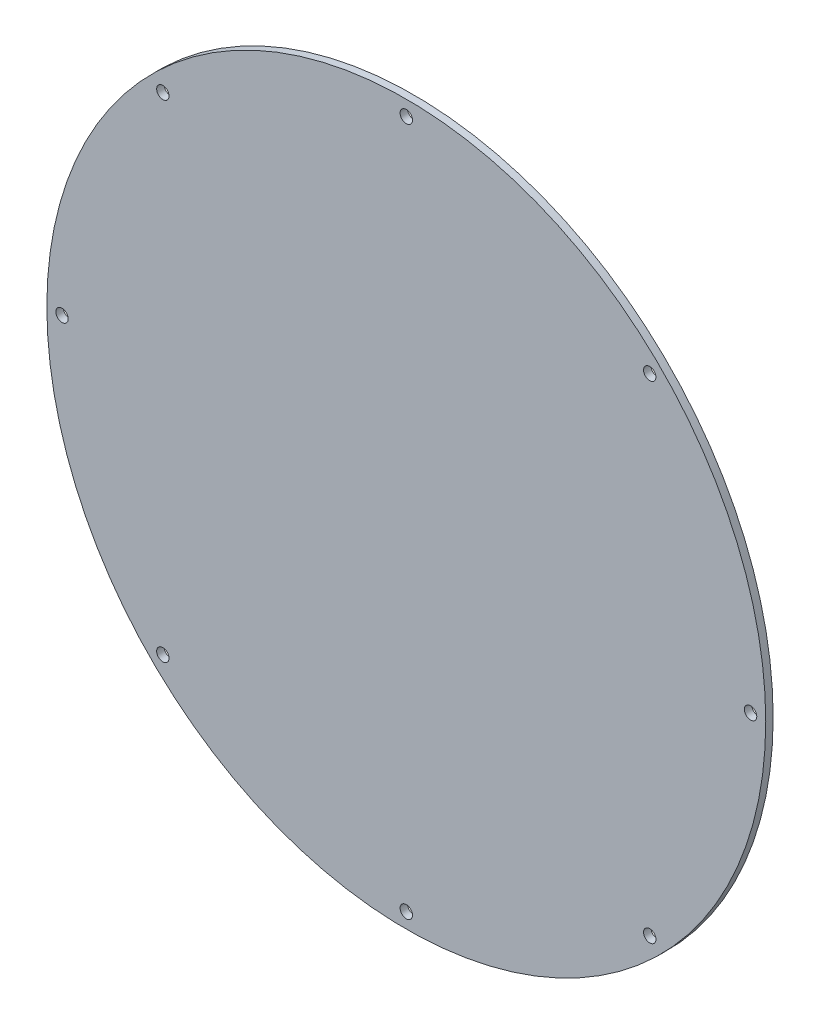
ISO-10303-21;
HEADER;
FILE_DESCRIPTION(('STEP AP214'),'2;1');
FILE_NAME('part.step','',(''),(''),'','','');
FILE_SCHEMA(('AUTOMOTIVE_DESIGN { 1 0 10303 214 1 1 1 1 }'));
ENDSEC;
DATA;
#1=APPLICATION_CONTEXT('core data for automotive mechanical design processes');
#2=APPLICATION_PROTOCOL_DEFINITION('international standard','automotive_design',2000,#1);
#3=PRODUCT_CONTEXT('',#1,'mechanical');
#4=PRODUCT('Part','Part','',(#3));
#5=PRODUCT_RELATED_PRODUCT_CATEGORY('part','',(#4));
#6=PRODUCT_DEFINITION_FORMATION('','',#4);
#7=PRODUCT_DEFINITION_CONTEXT('part definition',#1,'design');
#8=PRODUCT_DEFINITION('design','',#6,#7);
#9=PRODUCT_DEFINITION_SHAPE('','',#8);
#10=(LENGTH_UNIT() NAMED_UNIT(*) SI_UNIT(.MILLI.,.METRE.));
#11=(NAMED_UNIT(*) PLANE_ANGLE_UNIT() SI_UNIT($,.RADIAN.));
#12=(NAMED_UNIT(*) SI_UNIT($,.STERADIAN.) SOLID_ANGLE_UNIT());
#13=UNCERTAINTY_MEASURE_WITH_UNIT(LENGTH_MEASURE(1.E-05),#10,'distance_accuracy_value','');
#14=(GEOMETRIC_REPRESENTATION_CONTEXT(3) GLOBAL_UNCERTAINTY_ASSIGNED_CONTEXT((#13)) GLOBAL_UNIT_ASSIGNED_CONTEXT((#10,
#11,#12)) REPRESENTATION_CONTEXT('',''));
#15=CARTESIAN_POINT('',(0.,0.,0.));
#16=DIRECTION('',(0.,0.,1.));
#17=DIRECTION('',(1.,0.,0.));
#18=AXIS2_PLACEMENT_3D('',#15,#16,#17);
#19=CARTESIAN_POINT('',(0.,0.,3.17500000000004));
#20=DIRECTION('',(0.,0.,-1.));
#21=DIRECTION('',(-1.,0.,0.));
#22=AXIS2_PLACEMENT_3D('',#19,#20,#21);
#23=CYLINDRICAL_SURFACE('',#22,154.);
#24=CARTESIAN_POINT('',(0.,0.,3.17500000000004));
#25=DIRECTION('',(0.,0.,1.));
#26=DIRECTION('',(1.,0.,0.));
#27=AXIS2_PLACEMENT_3D('',#24,#25,#26);
#28=CIRCLE('',#27,154.);
#29=CARTESIAN_POINT('',(-154.,0.,3.17500000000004));
#30=VERTEX_POINT('',#29);
#31=EDGE_CURVE('E10',#30,#30,#28,.T.);
#32=CARTESIAN_POINT('',(0.,0.,0.));
#33=DIRECTION('',(0.,0.,1.));
#34=DIRECTION('',(1.,0.,0.));
#35=AXIS2_PLACEMENT_3D('',#32,#33,#34);
#36=CIRCLE('',#35,154.);
#37=CARTESIAN_POINT('',(-154.,0.,0.));
#38=VERTEX_POINT('',#37);
#39=EDGE_CURVE('E37',#38,#38,#36,.T.);
#40=CARTESIAN_POINT('',(-154.,0.,3.17500000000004));
#41=CARTESIAN_POINT('',(-154.,0.,3.14192708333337));
#42=CARTESIAN_POINT('',(-154.,0.,3.1088541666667));
#43=CARTESIAN_POINT('',(-154.,0.,3.04270833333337));
#44=CARTESIAN_POINT('',(-154.,0.,3.0096354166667));
#45=CARTESIAN_POINT('',(-154.,0.,2.94348958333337));
#46=CARTESIAN_POINT('',(-154.,0.,2.9104166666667));
#47=CARTESIAN_POINT('',(-154.,0.,2.84427083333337));
#48=CARTESIAN_POINT('',(-154.,0.,2.8111979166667));
#49=CARTESIAN_POINT('',(-154.,0.,2.74505208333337));
#50=CARTESIAN_POINT('',(-154.,0.,2.7119791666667));
#51=CARTESIAN_POINT('',(-154.,0.,2.64583333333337));
#52=CARTESIAN_POINT('',(-154.,0.,2.6127604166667));
#53=CARTESIAN_POINT('',(-154.,0.,2.54661458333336));
#54=CARTESIAN_POINT('',(-154.,0.,2.5135416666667));
#55=CARTESIAN_POINT('',(-154.,0.,2.44739583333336));
#56=CARTESIAN_POINT('',(-154.,0.,2.4143229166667));
#57=CARTESIAN_POINT('',(-154.,0.,2.34817708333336));
#58=CARTESIAN_POINT('',(-154.,0.,2.31510416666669));
#59=CARTESIAN_POINT('',(-154.,0.,2.24895833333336));
#60=CARTESIAN_POINT('',(-154.,0.,2.21588541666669));
#61=CARTESIAN_POINT('',(-154.,0.,2.14973958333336));
#62=CARTESIAN_POINT('',(-154.,0.,2.11666666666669));
#63=CARTESIAN_POINT('',(-154.,0.,2.05052083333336));
#64=CARTESIAN_POINT('',(-154.,0.,2.01744791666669));
#65=CARTESIAN_POINT('',(-154.,0.,1.95130208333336));
#66=CARTESIAN_POINT('',(-154.,0.,1.91822916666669));
#67=CARTESIAN_POINT('',(-154.,0.,1.85208333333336));
#68=CARTESIAN_POINT('',(-154.,0.,1.81901041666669));
#69=CARTESIAN_POINT('',(-154.,0.,1.75286458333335));
#70=CARTESIAN_POINT('',(-154.,0.,1.71979166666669));
#71=CARTESIAN_POINT('',(-154.,0.,1.65364583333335));
#72=CARTESIAN_POINT('',(-154.,0.,1.62057291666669));
#73=CARTESIAN_POINT('',(-154.,0.,1.55442708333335));
#74=CARTESIAN_POINT('',(-154.,0.,1.52135416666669));
#75=CARTESIAN_POINT('',(-154.,0.,1.45520833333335));
#76=CARTESIAN_POINT('',(-154.,0.,1.42213541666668));
#77=CARTESIAN_POINT('',(-154.,0.,1.35598958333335));
#78=CARTESIAN_POINT('',(-154.,0.,1.32291666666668));
#79=CARTESIAN_POINT('',(-154.,0.,1.25677083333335));
#80=CARTESIAN_POINT('',(-154.,0.,1.22369791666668));
#81=CARTESIAN_POINT('',(-154.,0.,1.15755208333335));
#82=CARTESIAN_POINT('',(-154.,0.,1.12447916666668));
#83=CARTESIAN_POINT('',(-154.,0.,1.05833333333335));
#84=CARTESIAN_POINT('',(-154.,0.,1.02526041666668));
#85=CARTESIAN_POINT('',(-154.,0.,0.959114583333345));
#86=CARTESIAN_POINT('',(-154.,0.,0.926041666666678));
#87=CARTESIAN_POINT('',(-154.,0.,0.859895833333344));
#88=CARTESIAN_POINT('',(-154.,0.,0.826822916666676));
#89=CARTESIAN_POINT('',(-154.,0.,0.760677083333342));
#90=CARTESIAN_POINT('',(-154.,0.,0.727604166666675));
#91=CARTESIAN_POINT('',(-154.,0.,0.661458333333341));
#92=CARTESIAN_POINT('',(-154.,0.,0.628385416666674));
#93=CARTESIAN_POINT('',(-154.,0.,0.56223958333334));
#94=CARTESIAN_POINT('',(-154.,0.,0.529166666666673));
#95=CARTESIAN_POINT('',(-154.,0.,0.463020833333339));
#96=CARTESIAN_POINT('',(-154.,0.,0.429947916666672));
#97=CARTESIAN_POINT('',(-154.,0.,0.363802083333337));
#98=CARTESIAN_POINT('',(-154.,0.,0.33072916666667));
#99=CARTESIAN_POINT('',(-154.,0.,0.264583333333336));
#100=CARTESIAN_POINT('',(-154.,0.,0.231510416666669));
#101=CARTESIAN_POINT('',(-154.,0.,0.165364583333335));
#102=CARTESIAN_POINT('',(-154.,0.,0.132291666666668));
#103=CARTESIAN_POINT('',(-154.,0.,0.0661458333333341));
#104=CARTESIAN_POINT('',(-154.,0.,0.0330729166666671));
#105=CARTESIAN_POINT('',(-154.,0.,0.));
#106=B_SPLINE_CURVE_WITH_KNOTS('',3,(#40,#41,#42,#43,#44,#45,#46,#47,#48,#49,#50,#51,#52,#53,
#54,#55,#56,#57,#58,#59,#60,#61,#62,#63,#64,#65,#66,#67,#68,#69,#70,#71,#72,#73,#74,#75,#76,#77,
#78,#79,#80,#81,#82,#83,#84,#85,#86,#87,#88,#89,#90,#91,#92,#93,#94,#95,#96,#97,#98,#99,#100,
#101,#102,#103,#104,#105),.UNSPECIFIED.,.F.,.F.,(4,2,2,2,2,2,2,2,2,2,2,2,2,2,2,2,2,2,2,2,2,2,2,
2,2,2,2,2,2,2,2,2,4),(0.,0.0992187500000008,0.198437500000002,0.297656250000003,
0.396875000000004,0.496093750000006,0.595312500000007,0.694531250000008,0.793750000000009,
0.892968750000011,0.992187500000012,1.09140625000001,1.19062500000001,1.28984375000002,
1.38906250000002,1.48828125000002,1.58750000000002,1.68671875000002,1.78593750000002,
1.88515625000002,1.98437500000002,2.08359375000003,2.18281250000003,2.28203125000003,
2.38125000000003,2.48046875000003,2.57968750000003,2.67890625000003,2.77812500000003,
2.87734375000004,2.97656250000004,3.07578125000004,3.17500000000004),.UNSPECIFIED.);
#107=EDGE_CURVE('BSEAM34',#30,#38,#106,.T.);
#108=ORIENTED_EDGE('',*,*,#31,.F.);
#109=ORIENTED_EDGE('',*,*,#39,.T.);
#110=ORIENTED_EDGE('',*,*,#107,.T.);
#111=ORIENTED_EDGE('',*,*,#107,.F.);
#112=EDGE_LOOP('',(#108,#110,#109,#111));
#113=FACE_BOUND('',#112,.T.);
#114=ADVANCED_FACE('F34',(#113),#23,.T.);
#115=CARTESIAN_POINT('',(0.,0.,3.17500000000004));
#116=DIRECTION('',(0.,0.,1.));
#117=DIRECTION('',(1.,0.,0.));
#118=AXIS2_PLACEMENT_3D('',#115,#116,#117);
#119=PLANE('',#118);
#120=CARTESIAN_POINT('',(104.298250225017,-104.298250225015,3.17500000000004));
#121=DIRECTION('',(0.,0.,1.));
#122=DIRECTION('',(0.707106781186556,-0.707106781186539,0.));
#123=AXIS2_PLACEMENT_3D('',#120,#121,#122);
#124=CIRCLE('',#123,2.64999999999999);
#125=CARTESIAN_POINT('',(106.172083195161,-106.172083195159,3.17500000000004));
#126=VERTEX_POINT('',#125);
#127=EDGE_CURVE('E90',#126,#126,#124,.T.);
#128=ORIENTED_EDGE('',*,*,#127,.F.);
#129=EDGE_LOOP('',(#128));
#130=FACE_BOUND('',#129,.T.);
#131=CARTESIAN_POINT('',(9.99200722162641E-13,-147.5,3.17500000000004));
#132=DIRECTION('',(0.,0.,1.));
#133=DIRECTION('',(0.,-1.,0.));
#134=AXIS2_PLACEMENT_3D('',#131,#132,#133);
#135=CIRCLE('',#134,2.64999999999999);
#136=CARTESIAN_POINT('',(1.02709312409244E-12,-150.15,3.17500000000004));
#137=VERTEX_POINT('',#136);
#138=EDGE_CURVE('E84',#137,#137,#135,.T.);
#139=ORIENTED_EDGE('',*,*,#138,.F.);
#140=EDGE_LOOP('',(#139));
#141=FACE_BOUND('',#140,.T.);
#142=CARTESIAN_POINT('',(-104.298250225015,-104.298250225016,3.17500000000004));
#143=DIRECTION('',(0.,0.,1.));
#144=DIRECTION('',(-0.707106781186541,-0.707106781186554,0.));
#145=AXIS2_PLACEMENT_3D('',#142,#143,#144);
#146=CIRCLE('',#145,2.64999999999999);
#147=CARTESIAN_POINT('',(-106.17208319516,-106.172083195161,3.17500000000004));
#148=VERTEX_POINT('',#147);
#149=EDGE_CURVE('E78',#148,#148,#146,.T.);
#150=ORIENTED_EDGE('',*,*,#149,.F.);
#151=EDGE_LOOP('',(#150));
#152=FACE_BOUND('',#151,.T.);
#153=CARTESIAN_POINT('',(-147.5,5.55111512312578E-13,3.17500000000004));
#154=DIRECTION('',(0.,0.,1.));
#155=DIRECTION('',(-1.,0.,0.));
#156=AXIS2_PLACEMENT_3D('',#153,#154,#155);
#157=CIRCLE('',#156,2.64999999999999);
#158=CARTESIAN_POINT('',(-150.15,5.55247124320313E-13,3.17500000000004));
#159=VERTEX_POINT('',#158);
#160=EDGE_CURVE('E72',#159,#159,#157,.T.);
#161=ORIENTED_EDGE('',*,*,#160,.F.);
#162=EDGE_LOOP('',(#161));
#163=FACE_BOUND('',#162,.T.);
#164=CARTESIAN_POINT('',(-104.298250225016,104.298250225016,3.17500000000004));
#165=DIRECTION('',(0.,0.,1.));
#166=DIRECTION('',(-0.707106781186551,0.707106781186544,0.));
#167=AXIS2_PLACEMENT_3D('',#164,#165,#166);
#168=CIRCLE('',#167,2.64999999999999);
#169=CARTESIAN_POINT('',(-106.17208319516,106.17208319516,3.17500000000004));
#170=VERTEX_POINT('',#169);
#171=EDGE_CURVE('E66',#170,#170,#168,.T.);
#172=ORIENTED_EDGE('',*,*,#171,.F.);
#173=EDGE_LOOP('',(#172));
#174=FACE_BOUND('',#173,.T.);
#175=CARTESIAN_POINT('',(0.,147.5,3.17500000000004));
#176=DIRECTION('',(0.,0.,1.));
#177=DIRECTION('',(0.,1.,0.));
#178=AXIS2_PLACEMENT_3D('',#175,#176,#177);
#179=CIRCLE('',#178,2.64999999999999);
#180=CARTESIAN_POINT('',(0.,150.15,3.17500000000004));
#181=VERTEX_POINT('',#180);
#182=EDGE_CURVE('E60',#181,#181,#179,.T.);
#183=ORIENTED_EDGE('',*,*,#182,.F.);
#184=EDGE_LOOP('',(#183));
#185=FACE_BOUND('',#184,.T.);
#186=CARTESIAN_POINT('',(104.298250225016,104.298250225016,3.17500000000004));
#187=DIRECTION('',(0.,0.,1.));
#188=DIRECTION('',(0.707106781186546,0.707106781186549,0.));
#189=AXIS2_PLACEMENT_3D('',#186,#187,#188);
#190=CIRCLE('',#189,2.64999999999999);
#191=CARTESIAN_POINT('',(106.17208319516,106.17208319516,3.17500000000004));
#192=VERTEX_POINT('',#191);
#193=EDGE_CURVE('E54',#192,#192,#190,.T.);
#194=ORIENTED_EDGE('',*,*,#193,.F.);
#195=EDGE_LOOP('',(#194));
#196=FACE_BOUND('',#195,.T.);
#197=CARTESIAN_POINT('',(147.5,-4.9960036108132E-13,3.17500000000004));
#198=DIRECTION('',(0.,0.,1.));
#199=DIRECTION('',(1.,0.,0.));
#200=AXIS2_PLACEMENT_3D('',#197,#198,#199);
#201=CIRCLE('',#200,2.64999999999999);
#202=CARTESIAN_POINT('',(150.15,-4.99735973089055E-13,3.17500000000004));
#203=VERTEX_POINT('',#202);
#204=EDGE_CURVE('E48',#203,#203,#201,.T.);
#205=ORIENTED_EDGE('',*,*,#204,.F.);
#206=EDGE_LOOP('',(#205));
#207=FACE_BOUND('',#206,.T.);
#208=ORIENTED_EDGE('',*,*,#31,.T.);
#209=EDGE_LOOP('',(#208));
#210=FACE_BOUND('',#209,.T.);
#211=ADVANCED_FACE('F97',(#130,#141,#152,#163,#174,#185,#196,#207,#210),#119,.T.);
#212=CARTESIAN_POINT('',(0.,0.,0.));
#213=DIRECTION('',(0.,0.,1.));
#214=DIRECTION('',(1.,0.,0.));
#215=AXIS2_PLACEMENT_3D('',#212,#213,#214);
#216=PLANE('',#215);
#217=CARTESIAN_POINT('',(104.298250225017,-104.298250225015,0.));
#218=DIRECTION('',(0.,0.,1.));
#219=DIRECTION('',(0.707106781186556,-0.707106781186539,0.));
#220=AXIS2_PLACEMENT_3D('',#217,#218,#219);
#221=CIRCLE('',#220,2.64999999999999);
#222=CARTESIAN_POINT('',(106.172083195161,-106.172083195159,0.));
#223=VERTEX_POINT('',#222);
#224=EDGE_CURVE('E87',#223,#223,#221,.T.);
#225=ORIENTED_EDGE('',*,*,#224,.T.);
#226=EDGE_LOOP('',(#225));
#227=FACE_BOUND('',#226,.T.);
#228=CARTESIAN_POINT('',(1.11022302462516E-12,-147.5,0.));
#229=DIRECTION('',(0.,0.,1.));
#230=DIRECTION('',(0.,-1.,0.));
#231=AXIS2_PLACEMENT_3D('',#228,#229,#230);
#232=CIRCLE('',#231,2.64999999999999);
#233=CARTESIAN_POINT('',(1.02709312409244E-12,-150.15,0.));
#234=VERTEX_POINT('',#233);
#235=EDGE_CURVE('E81',#234,#234,#232,.T.);
#236=ORIENTED_EDGE('',*,*,#235,.T.);
#237=EDGE_LOOP('',(#236));
#238=FACE_BOUND('',#237,.T.);
#239=CARTESIAN_POINT('',(-104.298250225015,-104.298250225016,0.));
#240=DIRECTION('',(0.,0.,1.));
#241=DIRECTION('',(-0.707106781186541,-0.707106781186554,0.));
#242=AXIS2_PLACEMENT_3D('',#239,#240,#241);
#243=CIRCLE('',#242,2.64999999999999);
#244=CARTESIAN_POINT('',(-106.17208319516,-106.172083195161,0.));
#245=VERTEX_POINT('',#244);
#246=EDGE_CURVE('E75',#245,#245,#243,.T.);
#247=ORIENTED_EDGE('',*,*,#246,.T.);
#248=EDGE_LOOP('',(#247));
#249=FACE_BOUND('',#248,.T.);
#250=CARTESIAN_POINT('',(-147.5,4.9960036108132E-13,0.));
#251=DIRECTION('',(0.,0.,1.));
#252=DIRECTION('',(-1.,0.,0.));
#253=AXIS2_PLACEMENT_3D('',#250,#251,#252);
#254=CIRCLE('',#253,2.64999999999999);
#255=CARTESIAN_POINT('',(-150.15,5.55225093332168E-13,0.));
#256=VERTEX_POINT('',#255);
#257=EDGE_CURVE('E69',#256,#256,#254,.T.);
#258=ORIENTED_EDGE('',*,*,#257,.T.);
#259=EDGE_LOOP('',(#258));
#260=FACE_BOUND('',#259,.T.);
#261=CARTESIAN_POINT('',(-104.298250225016,104.298250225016,0.));
#262=DIRECTION('',(0.,0.,1.));
#263=DIRECTION('',(-0.707106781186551,0.707106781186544,0.));
#264=AXIS2_PLACEMENT_3D('',#261,#262,#263);
#265=CIRCLE('',#264,2.64999999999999);
#266=CARTESIAN_POINT('',(-106.17208319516,106.17208319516,0.));
#267=VERTEX_POINT('',#266);
#268=EDGE_CURVE('E63',#267,#267,#265,.T.);
#269=ORIENTED_EDGE('',*,*,#268,.T.);
#270=EDGE_LOOP('',(#269));
#271=FACE_BOUND('',#270,.T.);
#272=CARTESIAN_POINT('',(-1.11022302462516E-13,147.5,0.));
#273=DIRECTION('',(0.,0.,1.));
#274=DIRECTION('',(0.,1.,0.));
#275=AXIS2_PLACEMENT_3D('',#272,#273,#274);
#276=CIRCLE('',#275,2.64999999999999);
#277=CARTESIAN_POINT('',(0.,150.15,0.));
#278=VERTEX_POINT('',#277);
#279=EDGE_CURVE('E57',#278,#278,#276,.T.);
#280=ORIENTED_EDGE('',*,*,#279,.T.);
#281=EDGE_LOOP('',(#280));
#282=FACE_BOUND('',#281,.T.);
#283=CARTESIAN_POINT('',(104.298250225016,104.298250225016,0.));
#284=DIRECTION('',(0.,0.,1.));
#285=DIRECTION('',(0.707106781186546,0.707106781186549,0.));
#286=AXIS2_PLACEMENT_3D('',#283,#284,#285);
#287=CIRCLE('',#286,2.64999999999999);
#288=CARTESIAN_POINT('',(106.17208319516,106.17208319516,0.));
#289=VERTEX_POINT('',#288);
#290=EDGE_CURVE('E51',#289,#289,#287,.T.);
#291=ORIENTED_EDGE('',*,*,#290,.T.);
#292=EDGE_LOOP('',(#291));
#293=FACE_BOUND('',#292,.T.);
#294=CARTESIAN_POINT('',(147.5,-4.44089209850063E-13,0.));
#295=DIRECTION('',(0.,0.,1.));
#296=DIRECTION('',(1.,0.,0.));
#297=AXIS2_PLACEMENT_3D('',#294,#295,#296);
#298=CIRCLE('',#297,2.64999999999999);
#299=CARTESIAN_POINT('',(150.15,-4.997580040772E-13,0.));
#300=VERTEX_POINT('',#299);
#301=EDGE_CURVE('E44',#300,#300,#298,.T.);
#302=ORIENTED_EDGE('',*,*,#301,.T.);
#303=EDGE_LOOP('',(#302));
#304=FACE_BOUND('',#303,.T.);
#305=ORIENTED_EDGE('',*,*,#39,.F.);
#306=EDGE_LOOP('',(#305));
#307=FACE_BOUND('',#306,.T.);
#308=ADVANCED_FACE('F100',(#227,#238,#249,#260,#271,#282,#293,#304,#307),#216,.F.);
#309=CARTESIAN_POINT('',(147.5,-4.9960036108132E-13,3.17500000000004));
#310=DIRECTION('',(0.,0.,1.));
#311=DIRECTION('',(1.,0.,0.));
#312=AXIS2_PLACEMENT_3D('',#309,#310,#311);
#313=CYLINDRICAL_SURFACE('',#312,2.64999999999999);
#314=CARTESIAN_POINT('',(150.15,-4.99735973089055E-13,3.17500000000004));
#315=CARTESIAN_POINT('',(150.15,-4.99736202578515E-13,3.14192708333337));
#316=CARTESIAN_POINT('',(150.15,-4.99736432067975E-13,3.1088541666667));
#317=CARTESIAN_POINT('',(150.15,-4.99736891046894E-13,3.04270833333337));
#318=CARTESIAN_POINT('',(150.15,-4.99737120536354E-13,3.0096354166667));
#319=CARTESIAN_POINT('',(150.15,-4.99737579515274E-13,2.94348958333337));
#320=CARTESIAN_POINT('',(150.15,-4.99737809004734E-13,2.9104166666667));
#321=CARTESIAN_POINT('',(150.15,-4.99738267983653E-13,2.84427083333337));
#322=CARTESIAN_POINT('',(150.15,-4.99738497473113E-13,2.8111979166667));
#323=CARTESIAN_POINT('',(150.15,-4.99738956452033E-13,2.74505208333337));
#324=CARTESIAN_POINT('',(150.15,-4.99739185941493E-13,2.7119791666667));
#325=CARTESIAN_POINT('',(150.15,-4.99739644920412E-13,2.64583333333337));
#326=CARTESIAN_POINT('',(150.15,-4.99739874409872E-13,2.6127604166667));
#327=CARTESIAN_POINT('',(150.15,-4.99740333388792E-13,2.54661458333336));
#328=CARTESIAN_POINT('',(150.15,-4.99740562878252E-13,2.5135416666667));
#329=CARTESIAN_POINT('',(150.15,-4.99741021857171E-13,2.44739583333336));
#330=CARTESIAN_POINT('',(150.15,-4.99741251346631E-13,2.4143229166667));
#331=CARTESIAN_POINT('',(150.15,-4.99741710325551E-13,2.34817708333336));
#332=CARTESIAN_POINT('',(150.15,-4.99741939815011E-13,2.31510416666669));
#333=CARTESIAN_POINT('',(150.15,-4.99742398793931E-13,2.24895833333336));
#334=CARTESIAN_POINT('',(150.15,-4.9974262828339E-13,2.21588541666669));
#335=CARTESIAN_POINT('',(150.15,-4.9974308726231E-13,2.14973958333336));
#336=CARTESIAN_POINT('',(150.15,-4.9974331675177E-13,2.11666666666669));
#337=CARTESIAN_POINT('',(150.15,-4.9974377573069E-13,2.05052083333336));
#338=CARTESIAN_POINT('',(150.15,-4.99744005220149E-13,2.01744791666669));
#339=CARTESIAN_POINT('',(150.15,-4.99744464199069E-13,1.95130208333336));
#340=CARTESIAN_POINT('',(150.15,-4.99744693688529E-13,1.91822916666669));
#341=CARTESIAN_POINT('',(150.15,-4.99745152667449E-13,1.85208333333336));
#342=CARTESIAN_POINT('',(150.15,-4.99745382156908E-13,1.81901041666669));
#343=CARTESIAN_POINT('',(150.15,-4.99745841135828E-13,1.75286458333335));
#344=CARTESIAN_POINT('',(150.15,-4.99746070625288E-13,1.71979166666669));
#345=CARTESIAN_POINT('',(150.15,-4.99746529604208E-13,1.65364583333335));
#346=CARTESIAN_POINT('',(150.15,-4.99746759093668E-13,1.62057291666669));
#347=CARTESIAN_POINT('',(150.15,-4.99747218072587E-13,1.55442708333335));
#348=CARTESIAN_POINT('',(150.15,-4.99747447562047E-13,1.52135416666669));
#349=CARTESIAN_POINT('',(150.15,-4.99747906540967E-13,1.45520833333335));
#350=CARTESIAN_POINT('',(150.15,-4.99748136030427E-13,1.42213541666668));
#351=CARTESIAN_POINT('',(150.15,-4.99748595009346E-13,1.35598958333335));
#352=CARTESIAN_POINT('',(150.15,-4.99748824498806E-13,1.32291666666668));
#353=CARTESIAN_POINT('',(150.15,-4.99749283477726E-13,1.25677083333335));
#354=CARTESIAN_POINT('',(150.15,-4.99749512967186E-13,1.22369791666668));
#355=CARTESIAN_POINT('',(150.15,-4.99749971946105E-13,1.15755208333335));
#356=CARTESIAN_POINT('',(150.15,-4.99750201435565E-13,1.12447916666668));
#357=CARTESIAN_POINT('',(150.15,-4.99750660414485E-13,1.05833333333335));
#358=CARTESIAN_POINT('',(150.15,-4.99750889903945E-13,1.02526041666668));
#359=CARTESIAN_POINT('',(150.15,-4.99751348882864E-13,0.959114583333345));
#360=CARTESIAN_POINT('',(150.15,-4.99751578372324E-13,0.926041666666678));
#361=CARTESIAN_POINT('',(150.15,-4.99752037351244E-13,0.859895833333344));
#362=CARTESIAN_POINT('',(150.15,-4.99752266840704E-13,0.826822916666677));
#363=CARTESIAN_POINT('',(150.15,-4.99752725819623E-13,0.760677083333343));
#364=CARTESIAN_POINT('',(150.15,-4.99752955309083E-13,0.727604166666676));
#365=CARTESIAN_POINT('',(150.15,-4.99753414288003E-13,0.661458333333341));
#366=CARTESIAN_POINT('',(150.15,-4.99753643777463E-13,0.628385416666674));
#367=CARTESIAN_POINT('',(150.15,-4.99754102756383E-13,0.56223958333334));
#368=CARTESIAN_POINT('',(150.15,-4.99754332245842E-13,0.529166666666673));
#369=CARTESIAN_POINT('',(150.15,-4.99754791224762E-13,0.463020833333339));
#370=CARTESIAN_POINT('',(150.15,-4.99755020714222E-13,0.429947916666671));
#371=CARTESIAN_POINT('',(150.15,-4.99755479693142E-13,0.363802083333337));
#372=CARTESIAN_POINT('',(150.15,-4.99755709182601E-13,0.33072916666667));
#373=CARTESIAN_POINT('',(150.15,-4.99756168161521E-13,0.264583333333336));
#374=CARTESIAN_POINT('',(150.15,-4.99756397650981E-13,0.231510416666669));
#375=CARTESIAN_POINT('',(150.15,-4.99756856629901E-13,0.165364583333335));
#376=CARTESIAN_POINT('',(150.15,-4.9975708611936E-13,0.132291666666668));
#377=CARTESIAN_POINT('',(150.15,-4.9975754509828E-13,0.0661458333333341));
#378=CARTESIAN_POINT('',(150.15,-4.9975777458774E-13,0.0330729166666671));
#379=CARTESIAN_POINT('',(150.15,-4.997580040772E-13,0.));
#380=B_SPLINE_CURVE_WITH_KNOTS('',3,(#314,#315,#316,#317,#318,#319,#320,#321,#322,#323,#324,
#325,#326,#327,#328,#329,#330,#331,#332,#333,#334,#335,#336,#337,#338,#339,#340,#341,#342,#343,
#344,#345,#346,#347,#348,#349,#350,#351,#352,#353,#354,#355,#356,#357,#358,#359,#360,#361,#362,
#363,#364,#365,#366,#367,#368,#369,#370,#371,#372,#373,#374,#375,#376,#377,#378,#379),
.UNSPECIFIED.,.F.,.F.,(4,2,2,2,2,2,2,2,2,2,2,2,2,2,2,2,2,2,2,2,2,2,2,2,2,2,2,2,2,2,2,2,4),(0.,
0.0992187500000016,0.198437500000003,0.297656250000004,0.396875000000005,0.496093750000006,
0.595312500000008,0.694531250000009,0.79375000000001,0.892968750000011,0.992187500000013,
1.09140625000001,1.19062500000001,1.28984375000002,1.38906250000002,1.48828125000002,
1.58750000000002,1.68671875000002,1.78593750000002,1.88515625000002,1.98437500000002,
2.08359375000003,2.18281250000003,2.28203125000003,2.38125000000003,2.48046875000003,
2.57968750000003,2.67890625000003,2.77812500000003,2.87734375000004,2.97656250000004,
3.07578125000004,3.17500000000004),.UNSPECIFIED.);
#381=EDGE_CURVE('BSEAM116',#203,#300,#380,.T.);
#382=ORIENTED_EDGE('',*,*,#204,.T.);
#383=ORIENTED_EDGE('',*,*,#301,.F.);
#384=ORIENTED_EDGE('',*,*,#381,.T.);
#385=ORIENTED_EDGE('',*,*,#381,.F.);
#386=EDGE_LOOP('',(#382,#384,#383,#385));
#387=FACE_BOUND('',#386,.T.);
#388=ADVANCED_FACE('F116',(#387),#313,.F.);
#389=CARTESIAN_POINT('',(104.298250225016,104.298250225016,3.17500000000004));
#390=DIRECTION('',(0.,0.,1.));
#391=DIRECTION('',(0.707106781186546,0.707106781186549,0.));
#392=AXIS2_PLACEMENT_3D('',#389,#390,#391);
#393=CYLINDRICAL_SURFACE('',#392,2.64999999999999);
#394=CARTESIAN_POINT('',(106.17208319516,106.17208319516,3.17500000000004));
#395=CARTESIAN_POINT('',(106.17208319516,106.17208319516,3.14192708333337));
#396=CARTESIAN_POINT('',(106.17208319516,106.17208319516,3.10885416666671));
#397=CARTESIAN_POINT('',(106.17208319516,106.17208319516,3.04270833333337));
#398=CARTESIAN_POINT('',(106.17208319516,106.17208319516,3.00963541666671));
#399=CARTESIAN_POINT('',(106.17208319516,106.17208319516,2.94348958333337));
#400=CARTESIAN_POINT('',(106.17208319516,106.17208319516,2.91041666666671));
#401=CARTESIAN_POINT('',(106.17208319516,106.17208319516,2.84427083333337));
#402=CARTESIAN_POINT('',(106.17208319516,106.17208319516,2.81119791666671));
#403=CARTESIAN_POINT('',(106.17208319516,106.17208319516,2.74505208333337));
#404=CARTESIAN_POINT('',(106.17208319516,106.17208319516,2.71197916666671));
#405=CARTESIAN_POINT('',(106.17208319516,106.17208319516,2.64583333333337));
#406=CARTESIAN_POINT('',(106.17208319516,106.17208319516,2.61276041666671));
#407=CARTESIAN_POINT('',(106.17208319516,106.17208319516,2.54661458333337));
#408=CARTESIAN_POINT('',(106.17208319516,106.17208319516,2.51354166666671));
#409=CARTESIAN_POINT('',(106.17208319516,106.17208319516,2.44739583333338));
#410=CARTESIAN_POINT('',(106.17208319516,106.17208319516,2.41432291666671));
#411=CARTESIAN_POINT('',(106.17208319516,106.17208319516,2.34817708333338));
#412=CARTESIAN_POINT('',(106.17208319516,106.17208319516,2.31510416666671));
#413=CARTESIAN_POINT('',(106.17208319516,106.17208319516,2.24895833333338));
#414=CARTESIAN_POINT('',(106.17208319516,106.17208319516,2.21588541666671));
#415=CARTESIAN_POINT('',(106.17208319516,106.17208319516,2.14973958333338));
#416=CARTESIAN_POINT('',(106.17208319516,106.17208319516,2.11666666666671));
#417=CARTESIAN_POINT('',(106.17208319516,106.17208319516,2.05052083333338));
#418=CARTESIAN_POINT('',(106.17208319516,106.17208319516,2.01744791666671));
#419=CARTESIAN_POINT('',(106.17208319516,106.17208319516,1.95130208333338));
#420=CARTESIAN_POINT('',(106.17208319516,106.17208319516,1.91822916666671));
#421=CARTESIAN_POINT('',(106.17208319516,106.17208319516,1.85208333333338));
#422=CARTESIAN_POINT('',(106.17208319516,106.17208319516,1.81901041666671));
#423=CARTESIAN_POINT('',(106.17208319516,106.17208319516,1.75286458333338));
#424=CARTESIAN_POINT('',(106.17208319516,106.17208319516,1.71979166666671));
#425=CARTESIAN_POINT('',(106.17208319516,106.17208319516,1.65364583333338));
#426=CARTESIAN_POINT('',(106.17208319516,106.17208319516,1.62057291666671));
#427=CARTESIAN_POINT('',(106.17208319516,106.17208319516,1.55442708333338));
#428=CARTESIAN_POINT('',(106.17208319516,106.17208319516,1.52135416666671));
#429=CARTESIAN_POINT('',(106.17208319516,106.17208319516,1.45520833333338));
#430=CARTESIAN_POINT('',(106.17208319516,106.17208319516,1.42213541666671));
#431=CARTESIAN_POINT('',(106.17208319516,106.17208319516,1.35598958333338));
#432=CARTESIAN_POINT('',(106.17208319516,106.17208319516,1.32291666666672));
#433=CARTESIAN_POINT('',(106.17208319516,106.17208319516,1.25677083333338));
#434=CARTESIAN_POINT('',(106.17208319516,106.17208319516,1.22369791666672));
#435=CARTESIAN_POINT('',(106.17208319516,106.17208319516,1.15755208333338));
#436=CARTESIAN_POINT('',(106.17208319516,106.17208319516,1.12447916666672));
#437=CARTESIAN_POINT('',(106.17208319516,106.17208319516,1.05833333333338));
#438=CARTESIAN_POINT('',(106.17208319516,106.17208319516,1.02526041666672));
#439=CARTESIAN_POINT('',(106.17208319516,106.17208319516,0.959114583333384));
#440=CARTESIAN_POINT('',(106.17208319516,106.17208319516,0.926041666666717));
#441=CARTESIAN_POINT('',(106.17208319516,106.17208319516,0.859895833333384));
#442=CARTESIAN_POINT('',(106.17208319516,106.17208319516,0.826822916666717));
#443=CARTESIAN_POINT('',(106.17208319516,106.17208319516,0.760677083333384));
#444=CARTESIAN_POINT('',(106.17208319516,106.17208319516,0.727604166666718));
#445=CARTESIAN_POINT('',(106.17208319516,106.17208319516,0.661458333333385));
#446=CARTESIAN_POINT('',(106.17208319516,106.17208319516,0.628385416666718));
#447=CARTESIAN_POINT('',(106.17208319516,106.17208319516,0.562239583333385));
#448=CARTESIAN_POINT('',(106.17208319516,106.17208319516,0.529166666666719));
#449=CARTESIAN_POINT('',(106.17208319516,106.17208319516,0.463020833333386));
#450=CARTESIAN_POINT('',(106.17208319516,106.17208319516,0.429947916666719));
#451=CARTESIAN_POINT('',(106.17208319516,106.17208319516,0.363802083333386));
#452=CARTESIAN_POINT('',(106.17208319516,106.17208319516,0.33072916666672));
#453=CARTESIAN_POINT('',(106.17208319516,106.17208319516,0.264583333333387));
#454=CARTESIAN_POINT('',(106.17208319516,106.17208319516,0.231510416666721));
#455=CARTESIAN_POINT('',(106.17208319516,106.17208319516,0.165364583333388));
#456=CARTESIAN_POINT('',(106.17208319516,106.17208319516,0.132291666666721));
#457=CARTESIAN_POINT('',(106.17208319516,106.17208319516,0.0661458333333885));
#458=CARTESIAN_POINT('',(106.17208319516,106.17208319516,0.033072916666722));
#459=CARTESIAN_POINT('',(106.17208319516,106.17208319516,0.));
#460=B_SPLINE_CURVE_WITH_KNOTS('',3,(#394,#395,#396,#397,#398,#399,#400,#401,#402,#403,#404,
#405,#406,#407,#408,#409,#410,#411,#412,#413,#414,#415,#416,#417,#418,#419,#420,#421,#422,#423,
#424,#425,#426,#427,#428,#429,#430,#431,#432,#433,#434,#435,#436,#437,#438,#439,#440,#441,#442,
#443,#444,#445,#446,#447,#448,#449,#450,#451,#452,#453,#454,#455,#456,#457,#458,#459),
.UNSPECIFIED.,.F.,.F.,(4,2,2,2,2,2,2,2,2,2,2,2,2,2,2,2,2,2,2,2,2,2,2,2,2,2,2,2,2,2,2,2,4),(0.,
0.0992187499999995,0.198437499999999,0.297656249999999,0.396874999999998,0.496093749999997,
0.595312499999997,0.694531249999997,0.793749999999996,0.892968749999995,0.992187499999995,
1.09140624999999,1.19062499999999,1.28984374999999,1.38906249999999,1.48828124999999,
1.58749999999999,1.68671874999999,1.78593749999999,1.88515624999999,1.98437499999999,
2.08359374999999,2.18281249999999,2.28203124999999,2.38124999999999,2.48046874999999,
2.57968749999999,2.67890624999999,2.77812499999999,2.87734374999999,2.97656249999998,
3.07578124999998,3.17499999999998),.UNSPECIFIED.);
#461=EDGE_CURVE('BSEAM119',#192,#289,#460,.T.);
#462=ORIENTED_EDGE('',*,*,#193,.T.);
#463=ORIENTED_EDGE('',*,*,#290,.F.);
#464=ORIENTED_EDGE('',*,*,#461,.T.);
#465=ORIENTED_EDGE('',*,*,#461,.F.);
#466=EDGE_LOOP('',(#462,#464,#463,#465));
#467=FACE_BOUND('',#466,.T.);
#468=ADVANCED_FACE('F119',(#467),#393,.F.);
#469=CARTESIAN_POINT('',(0.,147.5,3.17500000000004));
#470=DIRECTION('',(0.,0.,1.));
#471=DIRECTION('',(0.,1.,0.));
#472=AXIS2_PLACEMENT_3D('',#469,#470,#471);
#473=CYLINDRICAL_SURFACE('',#472,2.64999999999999);
#474=CARTESIAN_POINT('',(0.,150.15,3.17500000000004));
#475=CARTESIAN_POINT('',(0.,150.15,3.14192708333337));
#476=CARTESIAN_POINT('',(0.,150.15,3.1088541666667));
#477=CARTESIAN_POINT('',(0.,150.15,3.04270833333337));
#478=CARTESIAN_POINT('',(0.,150.15,3.0096354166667));
#479=CARTESIAN_POINT('',(0.,150.15,2.94348958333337));
#480=CARTESIAN_POINT('',(0.,150.15,2.9104166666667));
#481=CARTESIAN_POINT('',(0.,150.15,2.84427083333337));
#482=CARTESIAN_POINT('',(0.,150.15,2.8111979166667));
#483=CARTESIAN_POINT('',(0.,150.15,2.74505208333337));
#484=CARTESIAN_POINT('',(0.,150.15,2.7119791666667));
#485=CARTESIAN_POINT('',(0.,150.15,2.64583333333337));
#486=CARTESIAN_POINT('',(0.,150.15,2.6127604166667));
#487=CARTESIAN_POINT('',(0.,150.15,2.54661458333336));
#488=CARTESIAN_POINT('',(0.,150.15,2.5135416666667));
#489=CARTESIAN_POINT('',(0.,150.15,2.44739583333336));
#490=CARTESIAN_POINT('',(0.,150.15,2.4143229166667));
#491=CARTESIAN_POINT('',(0.,150.15,2.34817708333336));
#492=CARTESIAN_POINT('',(0.,150.15,2.31510416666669));
#493=CARTESIAN_POINT('',(0.,150.15,2.24895833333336));
#494=CARTESIAN_POINT('',(0.,150.15,2.21588541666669));
#495=CARTESIAN_POINT('',(0.,150.15,2.14973958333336));
#496=CARTESIAN_POINT('',(0.,150.15,2.11666666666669));
#497=CARTESIAN_POINT('',(0.,150.15,2.05052083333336));
#498=CARTESIAN_POINT('',(0.,150.15,2.01744791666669));
#499=CARTESIAN_POINT('',(0.,150.15,1.95130208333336));
#500=CARTESIAN_POINT('',(0.,150.15,1.91822916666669));
#501=CARTESIAN_POINT('',(0.,150.15,1.85208333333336));
#502=CARTESIAN_POINT('',(0.,150.15,1.81901041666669));
#503=CARTESIAN_POINT('',(0.,150.15,1.75286458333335));
#504=CARTESIAN_POINT('',(0.,150.15,1.71979166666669));
#505=CARTESIAN_POINT('',(0.,150.15,1.65364583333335));
#506=CARTESIAN_POINT('',(0.,150.15,1.62057291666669));
#507=CARTESIAN_POINT('',(0.,150.15,1.55442708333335));
#508=CARTESIAN_POINT('',(0.,150.15,1.52135416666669));
#509=CARTESIAN_POINT('',(0.,150.15,1.45520833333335));
#510=CARTESIAN_POINT('',(0.,150.15,1.42213541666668));
#511=CARTESIAN_POINT('',(0.,150.15,1.35598958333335));
#512=CARTESIAN_POINT('',(0.,150.15,1.32291666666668));
#513=CARTESIAN_POINT('',(0.,150.15,1.25677083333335));
#514=CARTESIAN_POINT('',(0.,150.15,1.22369791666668));
#515=CARTESIAN_POINT('',(0.,150.15,1.15755208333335));
#516=CARTESIAN_POINT('',(0.,150.15,1.12447916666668));
#517=CARTESIAN_POINT('',(0.,150.15,1.05833333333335));
#518=CARTESIAN_POINT('',(0.,150.15,1.02526041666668));
#519=CARTESIAN_POINT('',(0.,150.15,0.959114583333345));
#520=CARTESIAN_POINT('',(0.,150.15,0.926041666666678));
#521=CARTESIAN_POINT('',(0.,150.15,0.859895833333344));
#522=CARTESIAN_POINT('',(0.,150.15,0.826822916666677));
#523=CARTESIAN_POINT('',(0.,150.15,0.760677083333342));
#524=CARTESIAN_POINT('',(0.,150.15,0.727604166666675));
#525=CARTESIAN_POINT('',(0.,150.15,0.661458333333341));
#526=CARTESIAN_POINT('',(0.,150.15,0.628385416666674));
#527=CARTESIAN_POINT('',(0.,150.15,0.56223958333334));
#528=CARTESIAN_POINT('',(0.,150.15,0.529166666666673));
#529=CARTESIAN_POINT('',(0.,150.15,0.463020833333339));
#530=CARTESIAN_POINT('',(0.,150.15,0.429947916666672));
#531=CARTESIAN_POINT('',(0.,150.15,0.363802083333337));
#532=CARTESIAN_POINT('',(0.,150.15,0.33072916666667));
#533=CARTESIAN_POINT('',(0.,150.15,0.264583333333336));
#534=CARTESIAN_POINT('',(0.,150.15,0.231510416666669));
#535=CARTESIAN_POINT('',(0.,150.15,0.165364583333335));
#536=CARTESIAN_POINT('',(0.,150.15,0.132291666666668));
#537=CARTESIAN_POINT('',(0.,150.15,0.0661458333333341));
#538=CARTESIAN_POINT('',(0.,150.15,0.0330729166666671));
#539=CARTESIAN_POINT('',(0.,150.15,0.));
#540=B_SPLINE_CURVE_WITH_KNOTS('',3,(#474,#475,#476,#477,#478,#479,#480,#481,#482,#483,#484,
#485,#486,#487,#488,#489,#490,#491,#492,#493,#494,#495,#496,#497,#498,#499,#500,#501,#502,#503,
#504,#505,#506,#507,#508,#509,#510,#511,#512,#513,#514,#515,#516,#517,#518,#519,#520,#521,#522,
#523,#524,#525,#526,#527,#528,#529,#530,#531,#532,#533,#534,#535,#536,#537,#538,#539),
.UNSPECIFIED.,.F.,.F.,(4,2,2,2,2,2,2,2,2,2,2,2,2,2,2,2,2,2,2,2,2,2,2,2,2,2,2,2,2,2,2,2,4),(0.,
0.0992187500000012,0.198437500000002,0.297656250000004,0.396875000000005,0.496093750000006,
0.595312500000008,0.694531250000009,0.79375000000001,0.892968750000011,0.992187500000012,
1.09140625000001,1.19062500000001,1.28984375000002,1.38906250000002,1.48828125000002,
1.58750000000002,1.68671875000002,1.78593750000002,1.88515625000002,1.98437500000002,
2.08359375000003,2.18281250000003,2.28203125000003,2.38125000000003,2.48046875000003,
2.57968750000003,2.67890625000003,2.77812500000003,2.87734375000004,2.97656250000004,
3.07578125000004,3.17500000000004),.UNSPECIFIED.);
#541=EDGE_CURVE('BSEAM150',#181,#278,#540,.T.);
#542=ORIENTED_EDGE('',*,*,#182,.T.);
#543=ORIENTED_EDGE('',*,*,#279,.F.);
#544=ORIENTED_EDGE('',*,*,#541,.T.);
#545=ORIENTED_EDGE('',*,*,#541,.F.);
#546=EDGE_LOOP('',(#542,#544,#543,#545));
#547=FACE_BOUND('',#546,.T.);
#548=ADVANCED_FACE('F150',(#547),#473,.F.);
#549=CARTESIAN_POINT('',(-104.298250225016,104.298250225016,3.17500000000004));
#550=DIRECTION('',(0.,0.,1.));
#551=DIRECTION('',(-0.707106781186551,0.707106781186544,0.));
#552=AXIS2_PLACEMENT_3D('',#549,#550,#551);
#553=CYLINDRICAL_SURFACE('',#552,2.64999999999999);
#554=CARTESIAN_POINT('',(-106.17208319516,106.17208319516,3.17500000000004));
#555=CARTESIAN_POINT('',(-106.17208319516,106.17208319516,3.14192708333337));
#556=CARTESIAN_POINT('',(-106.17208319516,106.17208319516,3.1088541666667));
#557=CARTESIAN_POINT('',(-106.17208319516,106.17208319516,3.04270833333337));
#558=CARTESIAN_POINT('',(-106.17208319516,106.17208319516,3.0096354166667));
#559=CARTESIAN_POINT('',(-106.17208319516,106.17208319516,2.94348958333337));
#560=CARTESIAN_POINT('',(-106.17208319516,106.17208319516,2.9104166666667));
#561=CARTESIAN_POINT('',(-106.17208319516,106.17208319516,2.84427083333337));
#562=CARTESIAN_POINT('',(-106.17208319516,106.17208319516,2.8111979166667));
#563=CARTESIAN_POINT('',(-106.17208319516,106.17208319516,2.74505208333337));
#564=CARTESIAN_POINT('',(-106.17208319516,106.17208319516,2.7119791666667));
#565=CARTESIAN_POINT('',(-106.17208319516,106.17208319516,2.64583333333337));
#566=CARTESIAN_POINT('',(-106.17208319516,106.17208319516,2.6127604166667));
#567=CARTESIAN_POINT('',(-106.17208319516,106.17208319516,2.54661458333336));
#568=CARTESIAN_POINT('',(-106.17208319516,106.17208319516,2.5135416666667));
#569=CARTESIAN_POINT('',(-106.17208319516,106.17208319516,2.44739583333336));
#570=CARTESIAN_POINT('',(-106.17208319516,106.17208319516,2.4143229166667));
#571=CARTESIAN_POINT('',(-106.17208319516,106.17208319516,2.34817708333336));
#572=CARTESIAN_POINT('',(-106.17208319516,106.17208319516,2.31510416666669));
#573=CARTESIAN_POINT('',(-106.17208319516,106.17208319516,2.24895833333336));
#574=CARTESIAN_POINT('',(-106.17208319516,106.17208319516,2.21588541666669));
#575=CARTESIAN_POINT('',(-106.17208319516,106.17208319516,2.14973958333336));
#576=CARTESIAN_POINT('',(-106.17208319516,106.17208319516,2.11666666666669));
#577=CARTESIAN_POINT('',(-106.17208319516,106.17208319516,2.05052083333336));
#578=CARTESIAN_POINT('',(-106.17208319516,106.17208319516,2.01744791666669));
#579=CARTESIAN_POINT('',(-106.17208319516,106.17208319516,1.95130208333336));
#580=CARTESIAN_POINT('',(-106.17208319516,106.17208319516,1.91822916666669));
#581=CARTESIAN_POINT('',(-106.17208319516,106.17208319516,1.85208333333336));
#582=CARTESIAN_POINT('',(-106.17208319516,106.17208319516,1.81901041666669));
#583=CARTESIAN_POINT('',(-106.17208319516,106.17208319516,1.75286458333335));
#584=CARTESIAN_POINT('',(-106.17208319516,106.17208319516,1.71979166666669));
#585=CARTESIAN_POINT('',(-106.17208319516,106.17208319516,1.65364583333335));
#586=CARTESIAN_POINT('',(-106.17208319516,106.17208319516,1.62057291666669));
#587=CARTESIAN_POINT('',(-106.17208319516,106.17208319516,1.55442708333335));
#588=CARTESIAN_POINT('',(-106.17208319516,106.17208319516,1.52135416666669));
#589=CARTESIAN_POINT('',(-106.17208319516,106.17208319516,1.45520833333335));
#590=CARTESIAN_POINT('',(-106.17208319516,106.17208319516,1.42213541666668));
#591=CARTESIAN_POINT('',(-106.17208319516,106.17208319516,1.35598958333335));
#592=CARTESIAN_POINT('',(-106.17208319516,106.17208319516,1.32291666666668));
#593=CARTESIAN_POINT('',(-106.17208319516,106.17208319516,1.25677083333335));
#594=CARTESIAN_POINT('',(-106.17208319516,106.17208319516,1.22369791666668));
#595=CARTESIAN_POINT('',(-106.17208319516,106.17208319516,1.15755208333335));
#596=CARTESIAN_POINT('',(-106.17208319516,106.17208319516,1.12447916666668));
#597=CARTESIAN_POINT('',(-106.17208319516,106.17208319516,1.05833333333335));
#598=CARTESIAN_POINT('',(-106.17208319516,106.17208319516,1.02526041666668));
#599=CARTESIAN_POINT('',(-106.17208319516,106.17208319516,0.959114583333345));
#600=CARTESIAN_POINT('',(-106.17208319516,106.17208319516,0.926041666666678));
#601=CARTESIAN_POINT('',(-106.17208319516,106.17208319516,0.859895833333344));
#602=CARTESIAN_POINT('',(-106.17208319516,106.17208319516,0.826822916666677));
#603=CARTESIAN_POINT('',(-106.17208319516,106.17208319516,0.760677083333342));
#604=CARTESIAN_POINT('',(-106.17208319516,106.17208319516,0.727604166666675));
#605=CARTESIAN_POINT('',(-106.17208319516,106.17208319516,0.661458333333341));
#606=CARTESIAN_POINT('',(-106.17208319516,106.17208319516,0.628385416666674));
#607=CARTESIAN_POINT('',(-106.17208319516,106.17208319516,0.56223958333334));
#608=CARTESIAN_POINT('',(-106.17208319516,106.17208319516,0.529166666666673));
#609=CARTESIAN_POINT('',(-106.17208319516,106.17208319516,0.463020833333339));
#610=CARTESIAN_POINT('',(-106.17208319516,106.17208319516,0.429947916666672));
#611=CARTESIAN_POINT('',(-106.17208319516,106.17208319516,0.363802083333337));
#612=CARTESIAN_POINT('',(-106.17208319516,106.17208319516,0.33072916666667));
#613=CARTESIAN_POINT('',(-106.17208319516,106.17208319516,0.264583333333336));
#614=CARTESIAN_POINT('',(-106.17208319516,106.17208319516,0.231510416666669));
#615=CARTESIAN_POINT('',(-106.17208319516,106.17208319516,0.165364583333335));
#616=CARTESIAN_POINT('',(-106.17208319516,106.17208319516,0.132291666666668));
#617=CARTESIAN_POINT('',(-106.17208319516,106.17208319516,0.0661458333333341));
#618=CARTESIAN_POINT('',(-106.17208319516,106.17208319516,0.0330729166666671));
#619=CARTESIAN_POINT('',(-106.17208319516,106.17208319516,0.));
#620=B_SPLINE_CURVE_WITH_KNOTS('',3,(#554,#555,#556,#557,#558,#559,#560,#561,#562,#563,#564,
#565,#566,#567,#568,#569,#570,#571,#572,#573,#574,#575,#576,#577,#578,#579,#580,#581,#582,#583,
#584,#585,#586,#587,#588,#589,#590,#591,#592,#593,#594,#595,#596,#597,#598,#599,#600,#601,#602,
#603,#604,#605,#606,#607,#608,#609,#610,#611,#612,#613,#614,#615,#616,#617,#618,#619),
.UNSPECIFIED.,.F.,.F.,(4,2,2,2,2,2,2,2,2,2,2,2,2,2,2,2,2,2,2,2,2,2,2,2,2,2,2,2,2,2,2,2,4),(0.,
0.0992187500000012,0.198437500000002,0.297656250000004,0.396875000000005,0.496093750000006,
0.595312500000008,0.694531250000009,0.79375000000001,0.892968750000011,0.992187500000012,
1.09140625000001,1.19062500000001,1.28984375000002,1.38906250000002,1.48828125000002,
1.58750000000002,1.68671875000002,1.78593750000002,1.88515625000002,1.98437500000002,
2.08359375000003,2.18281250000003,2.28203125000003,2.38125000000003,2.48046875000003,
2.57968750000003,2.67890625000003,2.77812500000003,2.87734375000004,2.97656250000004,
3.07578125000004,3.17500000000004),.UNSPECIFIED.);
#621=EDGE_CURVE('BSEAM158',#170,#267,#620,.T.);
#622=ORIENTED_EDGE('',*,*,#171,.T.);
#623=ORIENTED_EDGE('',*,*,#268,.F.);
#624=ORIENTED_EDGE('',*,*,#621,.T.);
#625=ORIENTED_EDGE('',*,*,#621,.F.);
#626=EDGE_LOOP('',(#622,#624,#623,#625));
#627=FACE_BOUND('',#626,.T.);
#628=ADVANCED_FACE('F158',(#627),#553,.F.);
#629=CARTESIAN_POINT('',(-147.5,5.55111512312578E-13,3.17500000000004));
#630=DIRECTION('',(0.,0.,1.));
#631=DIRECTION('',(-1.,0.,0.));
#632=AXIS2_PLACEMENT_3D('',#629,#630,#631);
#633=CYLINDRICAL_SURFACE('',#632,2.64999999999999);
#634=CARTESIAN_POINT('',(-150.15,5.55247124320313E-13,3.17500000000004));
#635=CARTESIAN_POINT('',(-150.15,5.55246894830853E-13,3.14192708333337));
#636=CARTESIAN_POINT('',(-150.15,5.55246665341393E-13,3.10885416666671));
#637=CARTESIAN_POINT('',(-150.15,5.55246206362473E-13,3.04270833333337));
#638=CARTESIAN_POINT('',(-150.15,5.55245976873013E-13,3.00963541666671));
#639=CARTESIAN_POINT('',(-150.15,5.55245517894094E-13,2.94348958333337));
#640=CARTESIAN_POINT('',(-150.15,5.55245288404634E-13,2.91041666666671));
#641=CARTESIAN_POINT('',(-150.15,5.55244829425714E-13,2.84427083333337));
#642=CARTESIAN_POINT('',(-150.15,5.55244599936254E-13,2.81119791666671));
#643=CARTESIAN_POINT('',(-150.15,5.55244140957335E-13,2.74505208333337));
#644=CARTESIAN_POINT('',(-150.15,5.55243911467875E-13,2.71197916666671));
#645=CARTESIAN_POINT('',(-150.15,5.55243452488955E-13,2.64583333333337));
#646=CARTESIAN_POINT('',(-150.15,5.55243222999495E-13,2.61276041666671));
#647=CARTESIAN_POINT('',(-150.15,5.55242764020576E-13,2.54661458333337));
#648=CARTESIAN_POINT('',(-150.15,5.55242534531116E-13,2.51354166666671));
#649=CARTESIAN_POINT('',(-150.15,5.55242075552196E-13,2.44739583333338));
#650=CARTESIAN_POINT('',(-150.15,5.55241846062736E-13,2.41432291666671));
#651=CARTESIAN_POINT('',(-150.15,5.55241387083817E-13,2.34817708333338));
#652=CARTESIAN_POINT('',(-150.15,5.55241157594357E-13,2.31510416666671));
#653=CARTESIAN_POINT('',(-150.15,5.55240698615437E-13,2.24895833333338));
#654=CARTESIAN_POINT('',(-150.15,5.55240469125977E-13,2.21588541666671));
#655=CARTESIAN_POINT('',(-150.15,5.55240010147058E-13,2.14973958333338));
#656=CARTESIAN_POINT('',(-150.15,5.55239780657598E-13,2.11666666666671));
#657=CARTESIAN_POINT('',(-150.15,5.55239321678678E-13,2.05052083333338));
#658=CARTESIAN_POINT('',(-150.15,5.55239092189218E-13,2.01744791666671));
#659=CARTESIAN_POINT('',(-150.15,5.55238633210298E-13,1.95130208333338));
#660=CARTESIAN_POINT('',(-150.15,5.55238403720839E-13,1.91822916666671));
#661=CARTESIAN_POINT('',(-150.15,5.55237944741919E-13,1.85208333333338));
#662=CARTESIAN_POINT('',(-150.15,5.55237715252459E-13,1.81901041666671));
#663=CARTESIAN_POINT('',(-150.15,5.5523725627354E-13,1.75286458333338));
#664=CARTESIAN_POINT('',(-150.15,5.5523702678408E-13,1.71979166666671));
#665=CARTESIAN_POINT('',(-150.15,5.5523656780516E-13,1.65364583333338));
#666=CARTESIAN_POINT('',(-150.15,5.552363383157E-13,1.62057291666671));
#667=CARTESIAN_POINT('',(-150.15,5.5523587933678E-13,1.55442708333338));
#668=CARTESIAN_POINT('',(-150.15,5.55235649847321E-13,1.52135416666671));
#669=CARTESIAN_POINT('',(-150.15,5.55235190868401E-13,1.45520833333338));
#670=CARTESIAN_POINT('',(-150.15,5.55234961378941E-13,1.42213541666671));
#671=CARTESIAN_POINT('',(-150.15,5.55234502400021E-13,1.35598958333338));
#672=CARTESIAN_POINT('',(-150.15,5.55234272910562E-13,1.32291666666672));
#673=CARTESIAN_POINT('',(-150.15,5.55233813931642E-13,1.25677083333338));
#674=CARTESIAN_POINT('',(-150.15,5.55233584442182E-13,1.22369791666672));
#675=CARTESIAN_POINT('',(-150.15,5.55233125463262E-13,1.15755208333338));
#676=CARTESIAN_POINT('',(-150.15,5.55232895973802E-13,1.12447916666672));
#677=CARTESIAN_POINT('',(-150.15,5.55232436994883E-13,1.05833333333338));
#678=CARTESIAN_POINT('',(-150.15,5.55232207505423E-13,1.02526041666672));
#679=CARTESIAN_POINT('',(-150.15,5.55231748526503E-13,0.959114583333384));
#680=CARTESIAN_POINT('',(-150.15,5.55231519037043E-13,0.926041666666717));
#681=CARTESIAN_POINT('',(-150.15,5.55231060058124E-13,0.859895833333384));
#682=CARTESIAN_POINT('',(-150.15,5.55230830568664E-13,0.826822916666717));
#683=CARTESIAN_POINT('',(-150.15,5.55230371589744E-13,0.760677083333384));
#684=CARTESIAN_POINT('',(-150.15,5.55230142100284E-13,0.727604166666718));
#685=CARTESIAN_POINT('',(-150.15,5.55229683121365E-13,0.661458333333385));
#686=CARTESIAN_POINT('',(-150.15,5.55229453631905E-13,0.628385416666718));
#687=CARTESIAN_POINT('',(-150.15,5.55228994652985E-13,0.562239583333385));
#688=CARTESIAN_POINT('',(-150.15,5.55228765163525E-13,0.529166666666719));
#689=CARTESIAN_POINT('',(-150.15,5.55228306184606E-13,0.463020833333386));
#690=CARTESIAN_POINT('',(-150.15,5.55228076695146E-13,0.429947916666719));
#691=CARTESIAN_POINT('',(-150.15,5.55227617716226E-13,0.363802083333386));
#692=CARTESIAN_POINT('',(-150.15,5.55227388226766E-13,0.33072916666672));
#693=CARTESIAN_POINT('',(-150.15,5.55226929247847E-13,0.264583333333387));
#694=CARTESIAN_POINT('',(-150.15,5.55226699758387E-13,0.231510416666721));
#695=CARTESIAN_POINT('',(-150.15,5.55226240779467E-13,0.165364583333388));
#696=CARTESIAN_POINT('',(-150.15,5.55226011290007E-13,0.132291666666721));
#697=CARTESIAN_POINT('',(-150.15,5.55225552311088E-13,0.0661458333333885));
#698=CARTESIAN_POINT('',(-150.15,5.55225322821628E-13,0.033072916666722));
#699=CARTESIAN_POINT('',(-150.15,5.55225093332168E-13,0.));
#700=B_SPLINE_CURVE_WITH_KNOTS('',3,(#634,#635,#636,#637,#638,#639,#640,#641,#642,#643,#644,
#645,#646,#647,#648,#649,#650,#651,#652,#653,#654,#655,#656,#657,#658,#659,#660,#661,#662,#663,
#664,#665,#666,#667,#668,#669,#670,#671,#672,#673,#674,#675,#676,#677,#678,#679,#680,#681,#682,
#683,#684,#685,#686,#687,#688,#689,#690,#691,#692,#693,#694,#695,#696,#697,#698,#699),
.UNSPECIFIED.,.F.,.F.,(4,2,2,2,2,2,2,2,2,2,2,2,2,2,2,2,2,2,2,2,2,2,2,2,2,2,2,2,2,2,2,2,4),(0.,
0.0992187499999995,0.198437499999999,0.297656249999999,0.396874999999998,0.496093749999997,
0.595312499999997,0.694531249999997,0.793749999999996,0.892968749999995,0.992187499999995,
1.09140624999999,1.19062499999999,1.28984374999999,1.38906249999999,1.48828124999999,
1.58749999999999,1.68671874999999,1.78593749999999,1.88515624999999,1.98437499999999,
2.08359374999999,2.18281249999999,2.28203124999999,2.38124999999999,2.48046874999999,
2.57968749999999,2.67890624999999,2.77812499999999,2.87734374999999,2.97656249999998,
3.07578124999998,3.17499999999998),.UNSPECIFIED.);
#701=EDGE_CURVE('BSEAM166',#159,#256,#700,.T.);
#702=ORIENTED_EDGE('',*,*,#160,.T.);
#703=ORIENTED_EDGE('',*,*,#257,.F.);
#704=ORIENTED_EDGE('',*,*,#701,.T.);
#705=ORIENTED_EDGE('',*,*,#701,.F.);
#706=EDGE_LOOP('',(#702,#704,#703,#705));
#707=FACE_BOUND('',#706,.T.);
#708=ADVANCED_FACE('F166',(#707),#633,.F.);
#709=CARTESIAN_POINT('',(-104.298250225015,-104.298250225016,3.17500000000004));
#710=DIRECTION('',(0.,0.,1.));
#711=DIRECTION('',(-0.707106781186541,-0.707106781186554,0.));
#712=AXIS2_PLACEMENT_3D('',#709,#710,#711);
#713=CYLINDRICAL_SURFACE('',#712,2.64999999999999);
#714=CARTESIAN_POINT('',(-106.17208319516,-106.172083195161,3.17500000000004));
#715=CARTESIAN_POINT('',(-106.17208319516,-106.172083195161,3.14192708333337));
#716=CARTESIAN_POINT('',(-106.17208319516,-106.172083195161,3.10885416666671));
#717=CARTESIAN_POINT('',(-106.17208319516,-106.172083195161,3.04270833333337));
#718=CARTESIAN_POINT('',(-106.17208319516,-106.172083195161,3.00963541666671));
#719=CARTESIAN_POINT('',(-106.17208319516,-106.172083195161,2.94348958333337));
#720=CARTESIAN_POINT('',(-106.17208319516,-106.172083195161,2.91041666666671));
#721=CARTESIAN_POINT('',(-106.17208319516,-106.172083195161,2.84427083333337));
#722=CARTESIAN_POINT('',(-106.17208319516,-106.172083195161,2.81119791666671));
#723=CARTESIAN_POINT('',(-106.17208319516,-106.172083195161,2.74505208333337));
#724=CARTESIAN_POINT('',(-106.17208319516,-106.172083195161,2.71197916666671));
#725=CARTESIAN_POINT('',(-106.17208319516,-106.172083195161,2.64583333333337));
#726=CARTESIAN_POINT('',(-106.17208319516,-106.172083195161,2.61276041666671));
#727=CARTESIAN_POINT('',(-106.17208319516,-106.172083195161,2.54661458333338));
#728=CARTESIAN_POINT('',(-106.17208319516,-106.172083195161,2.51354166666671));
#729=CARTESIAN_POINT('',(-106.17208319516,-106.172083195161,2.44739583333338));
#730=CARTESIAN_POINT('',(-106.17208319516,-106.172083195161,2.41432291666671));
#731=CARTESIAN_POINT('',(-106.17208319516,-106.172083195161,2.34817708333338));
#732=CARTESIAN_POINT('',(-106.17208319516,-106.172083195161,2.31510416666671));
#733=CARTESIAN_POINT('',(-106.17208319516,-106.172083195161,2.24895833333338));
#734=CARTESIAN_POINT('',(-106.17208319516,-106.172083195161,2.21588541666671));
#735=CARTESIAN_POINT('',(-106.17208319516,-106.172083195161,2.14973958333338));
#736=CARTESIAN_POINT('',(-106.17208319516,-106.172083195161,2.11666666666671));
#737=CARTESIAN_POINT('',(-106.17208319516,-106.172083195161,2.05052083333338));
#738=CARTESIAN_POINT('',(-106.17208319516,-106.172083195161,2.01744791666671));
#739=CARTESIAN_POINT('',(-106.17208319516,-106.172083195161,1.95130208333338));
#740=CARTESIAN_POINT('',(-106.17208319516,-106.172083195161,1.91822916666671));
#741=CARTESIAN_POINT('',(-106.17208319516,-106.172083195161,1.85208333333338));
#742=CARTESIAN_POINT('',(-106.17208319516,-106.172083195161,1.81901041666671));
#743=CARTESIAN_POINT('',(-106.17208319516,-106.172083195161,1.75286458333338));
#744=CARTESIAN_POINT('',(-106.17208319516,-106.172083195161,1.71979166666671));
#745=CARTESIAN_POINT('',(-106.17208319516,-106.172083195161,1.65364583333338));
#746=CARTESIAN_POINT('',(-106.17208319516,-106.172083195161,1.62057291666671));
#747=CARTESIAN_POINT('',(-106.17208319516,-106.172083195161,1.55442708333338));
#748=CARTESIAN_POINT('',(-106.17208319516,-106.172083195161,1.52135416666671));
#749=CARTESIAN_POINT('',(-106.17208319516,-106.172083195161,1.45520833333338));
#750=CARTESIAN_POINT('',(-106.17208319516,-106.172083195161,1.42213541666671));
#751=CARTESIAN_POINT('',(-106.17208319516,-106.172083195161,1.35598958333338));
#752=CARTESIAN_POINT('',(-106.17208319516,-106.172083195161,1.32291666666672));
#753=CARTESIAN_POINT('',(-106.17208319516,-106.172083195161,1.25677083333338));
#754=CARTESIAN_POINT('',(-106.17208319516,-106.172083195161,1.22369791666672));
#755=CARTESIAN_POINT('',(-106.17208319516,-106.172083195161,1.15755208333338));
#756=CARTESIAN_POINT('',(-106.17208319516,-106.172083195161,1.12447916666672));
#757=CARTESIAN_POINT('',(-106.17208319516,-106.172083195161,1.05833333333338));
#758=CARTESIAN_POINT('',(-106.17208319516,-106.172083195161,1.02526041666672));
#759=CARTESIAN_POINT('',(-106.17208319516,-106.172083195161,0.959114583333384));
#760=CARTESIAN_POINT('',(-106.17208319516,-106.172083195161,0.926041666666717));
#761=CARTESIAN_POINT('',(-106.17208319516,-106.172083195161,0.859895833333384));
#762=CARTESIAN_POINT('',(-106.17208319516,-106.172083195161,0.826822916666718));
#763=CARTESIAN_POINT('',(-106.17208319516,-106.172083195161,0.760677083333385));
#764=CARTESIAN_POINT('',(-106.17208319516,-106.172083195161,0.727604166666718));
#765=CARTESIAN_POINT('',(-106.17208319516,-106.172083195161,0.661458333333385));
#766=CARTESIAN_POINT('',(-106.17208319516,-106.172083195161,0.628385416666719));
#767=CARTESIAN_POINT('',(-106.17208319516,-106.172083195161,0.562239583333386));
#768=CARTESIAN_POINT('',(-106.17208319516,-106.172083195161,0.529166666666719));
#769=CARTESIAN_POINT('',(-106.17208319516,-106.172083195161,0.463020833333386));
#770=CARTESIAN_POINT('',(-106.17208319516,-106.172083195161,0.429947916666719));
#771=CARTESIAN_POINT('',(-106.17208319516,-106.172083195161,0.363802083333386));
#772=CARTESIAN_POINT('',(-106.17208319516,-106.172083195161,0.33072916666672));
#773=CARTESIAN_POINT('',(-106.17208319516,-106.172083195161,0.264583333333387));
#774=CARTESIAN_POINT('',(-106.17208319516,-106.172083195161,0.231510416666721));
#775=CARTESIAN_POINT('',(-106.17208319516,-106.172083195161,0.165364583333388));
#776=CARTESIAN_POINT('',(-106.17208319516,-106.172083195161,0.132291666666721));
#777=CARTESIAN_POINT('',(-106.17208319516,-106.172083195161,0.0661458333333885));
#778=CARTESIAN_POINT('',(-106.17208319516,-106.172083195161,0.033072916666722));
#779=CARTESIAN_POINT('',(-106.17208319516,-106.172083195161,0.));
#780=B_SPLINE_CURVE_WITH_KNOTS('',3,(#714,#715,#716,#717,#718,#719,#720,#721,#722,#723,#724,
#725,#726,#727,#728,#729,#730,#731,#732,#733,#734,#735,#736,#737,#738,#739,#740,#741,#742,#743,
#744,#745,#746,#747,#748,#749,#750,#751,#752,#753,#754,#755,#756,#757,#758,#759,#760,#761,#762,
#763,#764,#765,#766,#767,#768,#769,#770,#771,#772,#773,#774,#775,#776,#777,#778,#779),
.UNSPECIFIED.,.F.,.F.,(4,2,2,2,2,2,2,2,2,2,2,2,2,2,2,2,2,2,2,2,2,2,2,2,2,2,2,2,2,2,2,2,4),(0.,
0.0992187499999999,0.198437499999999,0.297656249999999,0.396874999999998,0.496093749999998,
0.595312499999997,0.694531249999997,0.793749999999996,0.892968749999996,0.992187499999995,
1.09140624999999,1.19062499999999,1.28984374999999,1.38906249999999,1.48828124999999,
1.58749999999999,1.68671874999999,1.78593749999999,1.88515624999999,1.98437499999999,
2.08359374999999,2.18281249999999,2.28203124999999,2.38124999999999,2.48046874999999,
2.57968749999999,2.67890624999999,2.77812499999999,2.87734374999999,2.97656249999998,
3.07578124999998,3.17499999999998),.UNSPECIFIED.);
#781=EDGE_CURVE('BSEAM174',#148,#245,#780,.T.);
#782=ORIENTED_EDGE('',*,*,#149,.T.);
#783=ORIENTED_EDGE('',*,*,#246,.F.);
#784=ORIENTED_EDGE('',*,*,#781,.T.);
#785=ORIENTED_EDGE('',*,*,#781,.F.);
#786=EDGE_LOOP('',(#782,#784,#783,#785));
#787=FACE_BOUND('',#786,.T.);
#788=ADVANCED_FACE('F174',(#787),#713,.F.);
#789=CARTESIAN_POINT('',(9.99200722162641E-13,-147.5,3.17500000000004));
#790=DIRECTION('',(0.,0.,1.));
#791=DIRECTION('',(0.,-1.,0.));
#792=AXIS2_PLACEMENT_3D('',#789,#790,#791);
#793=CYLINDRICAL_SURFACE('',#792,2.64999999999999);
#794=CARTESIAN_POINT('',(1.02709312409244E-12,-150.15,3.17500000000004));
#795=CARTESIAN_POINT('',(1.02709312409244E-12,-150.15,3.14192708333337));
#796=CARTESIAN_POINT('',(1.02709312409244E-12,-150.15,3.10885416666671));
#797=CARTESIAN_POINT('',(1.02709312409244E-12,-150.15,3.04270833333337));
#798=CARTESIAN_POINT('',(1.02709312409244E-12,-150.15,3.00963541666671));
#799=CARTESIAN_POINT('',(1.02709312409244E-12,-150.15,2.94348958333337));
#800=CARTESIAN_POINT('',(1.02709312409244E-12,-150.15,2.91041666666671));
#801=CARTESIAN_POINT('',(1.02709312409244E-12,-150.15,2.84427083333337));
#802=CARTESIAN_POINT('',(1.02709312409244E-12,-150.15,2.81119791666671));
#803=CARTESIAN_POINT('',(1.02709312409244E-12,-150.15,2.74505208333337));
#804=CARTESIAN_POINT('',(1.02709312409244E-12,-150.15,2.71197916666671));
#805=CARTESIAN_POINT('',(1.02709312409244E-12,-150.15,2.64583333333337));
#806=CARTESIAN_POINT('',(1.02709312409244E-12,-150.15,2.61276041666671));
#807=CARTESIAN_POINT('',(1.02709312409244E-12,-150.15,2.54661458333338));
#808=CARTESIAN_POINT('',(1.02709312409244E-12,-150.15,2.51354166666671));
#809=CARTESIAN_POINT('',(1.02709312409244E-12,-150.15,2.44739583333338));
#810=CARTESIAN_POINT('',(1.02709312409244E-12,-150.15,2.41432291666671));
#811=CARTESIAN_POINT('',(1.02709312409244E-12,-150.15,2.34817708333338));
#812=CARTESIAN_POINT('',(1.02709312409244E-12,-150.15,2.31510416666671));
#813=CARTESIAN_POINT('',(1.02709312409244E-12,-150.15,2.24895833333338));
#814=CARTESIAN_POINT('',(1.02709312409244E-12,-150.15,2.21588541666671));
#815=CARTESIAN_POINT('',(1.02709312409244E-12,-150.15,2.14973958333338));
#816=CARTESIAN_POINT('',(1.02709312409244E-12,-150.15,2.11666666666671));
#817=CARTESIAN_POINT('',(1.02709312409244E-12,-150.15,2.05052083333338));
#818=CARTESIAN_POINT('',(1.02709312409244E-12,-150.15,2.01744791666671));
#819=CARTESIAN_POINT('',(1.02709312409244E-12,-150.15,1.95130208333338));
#820=CARTESIAN_POINT('',(1.02709312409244E-12,-150.15,1.91822916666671));
#821=CARTESIAN_POINT('',(1.02709312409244E-12,-150.15,1.85208333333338));
#822=CARTESIAN_POINT('',(1.02709312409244E-12,-150.15,1.81901041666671));
#823=CARTESIAN_POINT('',(1.02709312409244E-12,-150.15,1.75286458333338));
#824=CARTESIAN_POINT('',(1.02709312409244E-12,-150.15,1.71979166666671));
#825=CARTESIAN_POINT('',(1.02709312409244E-12,-150.15,1.65364583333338));
#826=CARTESIAN_POINT('',(1.02709312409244E-12,-150.15,1.62057291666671));
#827=CARTESIAN_POINT('',(1.02709312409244E-12,-150.15,1.55442708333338));
#828=CARTESIAN_POINT('',(1.02709312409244E-12,-150.15,1.52135416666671));
#829=CARTESIAN_POINT('',(1.02709312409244E-12,-150.15,1.45520833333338));
#830=CARTESIAN_POINT('',(1.02709312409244E-12,-150.15,1.42213541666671));
#831=CARTESIAN_POINT('',(1.02709312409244E-12,-150.15,1.35598958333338));
#832=CARTESIAN_POINT('',(1.02709312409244E-12,-150.15,1.32291666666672));
#833=CARTESIAN_POINT('',(1.02709312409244E-12,-150.15,1.25677083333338));
#834=CARTESIAN_POINT('',(1.02709312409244E-12,-150.15,1.22369791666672));
#835=CARTESIAN_POINT('',(1.02709312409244E-12,-150.15,1.15755208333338));
#836=CARTESIAN_POINT('',(1.02709312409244E-12,-150.15,1.12447916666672));
#837=CARTESIAN_POINT('',(1.02709312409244E-12,-150.15,1.05833333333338));
#838=CARTESIAN_POINT('',(1.02709312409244E-12,-150.15,1.02526041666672));
#839=CARTESIAN_POINT('',(1.02709312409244E-12,-150.15,0.959114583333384));
#840=CARTESIAN_POINT('',(1.02709312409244E-12,-150.15,0.926041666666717));
#841=CARTESIAN_POINT('',(1.02709312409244E-12,-150.15,0.859895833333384));
#842=CARTESIAN_POINT('',(1.02709312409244E-12,-150.15,0.826822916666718));
#843=CARTESIAN_POINT('',(1.02709312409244E-12,-150.15,0.760677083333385));
#844=CARTESIAN_POINT('',(1.02709312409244E-12,-150.15,0.727604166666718));
#845=CARTESIAN_POINT('',(1.02709312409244E-12,-150.15,0.661458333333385));
#846=CARTESIAN_POINT('',(1.02709312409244E-12,-150.15,0.628385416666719));
#847=CARTESIAN_POINT('',(1.02709312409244E-12,-150.15,0.562239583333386));
#848=CARTESIAN_POINT('',(1.02709312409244E-12,-150.15,0.529166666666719));
#849=CARTESIAN_POINT('',(1.02709312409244E-12,-150.15,0.463020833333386));
#850=CARTESIAN_POINT('',(1.02709312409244E-12,-150.15,0.429947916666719));
#851=CARTESIAN_POINT('',(1.02709312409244E-12,-150.15,0.363802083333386));
#852=CARTESIAN_POINT('',(1.02709312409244E-12,-150.15,0.33072916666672));
#853=CARTESIAN_POINT('',(1.02709312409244E-12,-150.15,0.264583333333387));
#854=CARTESIAN_POINT('',(1.02709312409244E-12,-150.15,0.231510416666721));
#855=CARTESIAN_POINT('',(1.02709312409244E-12,-150.15,0.165364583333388));
#856=CARTESIAN_POINT('',(1.02709312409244E-12,-150.15,0.132291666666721));
#857=CARTESIAN_POINT('',(1.02709312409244E-12,-150.15,0.0661458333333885));
#858=CARTESIAN_POINT('',(1.02709312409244E-12,-150.15,0.033072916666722));
#859=CARTESIAN_POINT('',(1.02709312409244E-12,-150.15,0.));
#860=B_SPLINE_CURVE_WITH_KNOTS('',3,(#794,#795,#796,#797,#798,#799,#800,#801,#802,#803,#804,
#805,#806,#807,#808,#809,#810,#811,#812,#813,#814,#815,#816,#817,#818,#819,#820,#821,#822,#823,
#824,#825,#826,#827,#828,#829,#830,#831,#832,#833,#834,#835,#836,#837,#838,#839,#840,#841,#842,
#843,#844,#845,#846,#847,#848,#849,#850,#851,#852,#853,#854,#855,#856,#857,#858,#859),
.UNSPECIFIED.,.F.,.F.,(4,2,2,2,2,2,2,2,2,2,2,2,2,2,2,2,2,2,2,2,2,2,2,2,2,2,2,2,2,2,2,2,4),(0.,
0.0992187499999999,0.198437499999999,0.297656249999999,0.396874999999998,0.496093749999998,
0.595312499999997,0.694531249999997,0.793749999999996,0.892968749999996,0.992187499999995,
1.09140624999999,1.19062499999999,1.28984374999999,1.38906249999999,1.48828124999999,
1.58749999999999,1.68671874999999,1.78593749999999,1.88515624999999,1.98437499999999,
2.08359374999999,2.18281249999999,2.28203124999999,2.38124999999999,2.48046874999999,
2.57968749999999,2.67890624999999,2.77812499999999,2.87734374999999,2.97656249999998,
3.07578124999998,3.17499999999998),.UNSPECIFIED.);
#861=EDGE_CURVE('BSEAM182',#137,#234,#860,.T.);
#862=ORIENTED_EDGE('',*,*,#138,.T.);
#863=ORIENTED_EDGE('',*,*,#235,.F.);
#864=ORIENTED_EDGE('',*,*,#861,.T.);
#865=ORIENTED_EDGE('',*,*,#861,.F.);
#866=EDGE_LOOP('',(#862,#864,#863,#865));
#867=FACE_BOUND('',#866,.T.);
#868=ADVANCED_FACE('F182',(#867),#793,.F.);
#869=CARTESIAN_POINT('',(104.298250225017,-104.298250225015,3.17500000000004));
#870=DIRECTION('',(0.,0.,1.));
#871=DIRECTION('',(0.707106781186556,-0.707106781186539,0.));
#872=AXIS2_PLACEMENT_3D('',#869,#870,#871);
#873=CYLINDRICAL_SURFACE('',#872,2.64999999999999);
#874=CARTESIAN_POINT('',(106.172083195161,-106.172083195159,3.17500000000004));
#875=CARTESIAN_POINT('',(106.172083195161,-106.172083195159,3.14192708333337));
#876=CARTESIAN_POINT('',(106.172083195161,-106.172083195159,3.10885416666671));
#877=CARTESIAN_POINT('',(106.172083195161,-106.172083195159,3.04270833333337));
#878=CARTESIAN_POINT('',(106.172083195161,-106.172083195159,3.00963541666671));
#879=CARTESIAN_POINT('',(106.172083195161,-106.172083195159,2.94348958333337));
#880=CARTESIAN_POINT('',(106.172083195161,-106.172083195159,2.91041666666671));
#881=CARTESIAN_POINT('',(106.172083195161,-106.172083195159,2.84427083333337));
#882=CARTESIAN_POINT('',(106.172083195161,-106.172083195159,2.81119791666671));
#883=CARTESIAN_POINT('',(106.172083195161,-106.172083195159,2.74505208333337));
#884=CARTESIAN_POINT('',(106.172083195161,-106.172083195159,2.71197916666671));
#885=CARTESIAN_POINT('',(106.172083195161,-106.172083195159,2.64583333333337));
#886=CARTESIAN_POINT('',(106.172083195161,-106.172083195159,2.61276041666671));
#887=CARTESIAN_POINT('',(106.172083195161,-106.172083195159,2.54661458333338));
#888=CARTESIAN_POINT('',(106.172083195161,-106.172083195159,2.51354166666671));
#889=CARTESIAN_POINT('',(106.172083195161,-106.172083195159,2.44739583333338));
#890=CARTESIAN_POINT('',(106.172083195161,-106.172083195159,2.41432291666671));
#891=CARTESIAN_POINT('',(106.172083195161,-106.172083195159,2.34817708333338));
#892=CARTESIAN_POINT('',(106.172083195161,-106.172083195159,2.31510416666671));
#893=CARTESIAN_POINT('',(106.172083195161,-106.172083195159,2.24895833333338));
#894=CARTESIAN_POINT('',(106.172083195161,-106.172083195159,2.21588541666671));
#895=CARTESIAN_POINT('',(106.172083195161,-106.172083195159,2.14973958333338));
#896=CARTESIAN_POINT('',(106.172083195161,-106.172083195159,2.11666666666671));
#897=CARTESIAN_POINT('',(106.172083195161,-106.172083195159,2.05052083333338));
#898=CARTESIAN_POINT('',(106.172083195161,-106.172083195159,2.01744791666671));
#899=CARTESIAN_POINT('',(106.172083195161,-106.172083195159,1.95130208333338));
#900=CARTESIAN_POINT('',(106.172083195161,-106.172083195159,1.91822916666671));
#901=CARTESIAN_POINT('',(106.172083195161,-106.172083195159,1.85208333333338));
#902=CARTESIAN_POINT('',(106.172083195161,-106.172083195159,1.81901041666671));
#903=CARTESIAN_POINT('',(106.172083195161,-106.172083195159,1.75286458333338));
#904=CARTESIAN_POINT('',(106.172083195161,-106.172083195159,1.71979166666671));
#905=CARTESIAN_POINT('',(106.172083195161,-106.172083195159,1.65364583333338));
#906=CARTESIAN_POINT('',(106.172083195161,-106.172083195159,1.62057291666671));
#907=CARTESIAN_POINT('',(106.172083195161,-106.172083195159,1.55442708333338));
#908=CARTESIAN_POINT('',(106.172083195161,-106.172083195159,1.52135416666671));
#909=CARTESIAN_POINT('',(106.172083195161,-106.172083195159,1.45520833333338));
#910=CARTESIAN_POINT('',(106.172083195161,-106.172083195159,1.42213541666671));
#911=CARTESIAN_POINT('',(106.172083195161,-106.172083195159,1.35598958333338));
#912=CARTESIAN_POINT('',(106.172083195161,-106.172083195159,1.32291666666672));
#913=CARTESIAN_POINT('',(106.172083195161,-106.172083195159,1.25677083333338));
#914=CARTESIAN_POINT('',(106.172083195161,-106.172083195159,1.22369791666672));
#915=CARTESIAN_POINT('',(106.172083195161,-106.172083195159,1.15755208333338));
#916=CARTESIAN_POINT('',(106.172083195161,-106.172083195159,1.12447916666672));
#917=CARTESIAN_POINT('',(106.172083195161,-106.172083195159,1.05833333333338));
#918=CARTESIAN_POINT('',(106.172083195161,-106.172083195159,1.02526041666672));
#919=CARTESIAN_POINT('',(106.172083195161,-106.172083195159,0.959114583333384));
#920=CARTESIAN_POINT('',(106.172083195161,-106.172083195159,0.926041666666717));
#921=CARTESIAN_POINT('',(106.172083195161,-106.172083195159,0.859895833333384));
#922=CARTESIAN_POINT('',(106.172083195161,-106.172083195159,0.826822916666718));
#923=CARTESIAN_POINT('',(106.172083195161,-106.172083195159,0.760677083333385));
#924=CARTESIAN_POINT('',(106.172083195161,-106.172083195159,0.727604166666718));
#925=CARTESIAN_POINT('',(106.172083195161,-106.172083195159,0.661458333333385));
#926=CARTESIAN_POINT('',(106.172083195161,-106.172083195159,0.628385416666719));
#927=CARTESIAN_POINT('',(106.172083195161,-106.172083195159,0.562239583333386));
#928=CARTESIAN_POINT('',(106.172083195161,-106.172083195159,0.529166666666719));
#929=CARTESIAN_POINT('',(106.172083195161,-106.172083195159,0.463020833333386));
#930=CARTESIAN_POINT('',(106.172083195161,-106.172083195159,0.429947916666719));
#931=CARTESIAN_POINT('',(106.172083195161,-106.172083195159,0.363802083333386));
#932=CARTESIAN_POINT('',(106.172083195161,-106.172083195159,0.33072916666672));
#933=CARTESIAN_POINT('',(106.172083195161,-106.172083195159,0.264583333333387));
#934=CARTESIAN_POINT('',(106.172083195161,-106.172083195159,0.231510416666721));
#935=CARTESIAN_POINT('',(106.172083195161,-106.172083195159,0.165364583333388));
#936=CARTESIAN_POINT('',(106.172083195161,-106.172083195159,0.132291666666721));
#937=CARTESIAN_POINT('',(106.172083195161,-106.172083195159,0.0661458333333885));
#938=CARTESIAN_POINT('',(106.172083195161,-106.172083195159,0.033072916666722));
#939=CARTESIAN_POINT('',(106.172083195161,-106.172083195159,0.));
#940=B_SPLINE_CURVE_WITH_KNOTS('',3,(#874,#875,#876,#877,#878,#879,#880,#881,#882,#883,#884,
#885,#886,#887,#888,#889,#890,#891,#892,#893,#894,#895,#896,#897,#898,#899,#900,#901,#902,#903,
#904,#905,#906,#907,#908,#909,#910,#911,#912,#913,#914,#915,#916,#917,#918,#919,#920,#921,#922,
#923,#924,#925,#926,#927,#928,#929,#930,#931,#932,#933,#934,#935,#936,#937,#938,#939),
.UNSPECIFIED.,.F.,.F.,(4,2,2,2,2,2,2,2,2,2,2,2,2,2,2,2,2,2,2,2,2,2,2,2,2,2,2,2,2,2,2,2,4),(0.,
0.0992187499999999,0.198437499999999,0.297656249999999,0.396874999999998,0.496093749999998,
0.595312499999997,0.694531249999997,0.793749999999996,0.892968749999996,0.992187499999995,
1.09140624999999,1.19062499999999,1.28984374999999,1.38906249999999,1.48828124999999,
1.58749999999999,1.68671874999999,1.78593749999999,1.88515624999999,1.98437499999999,
2.08359374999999,2.18281249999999,2.28203124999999,2.38124999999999,2.48046874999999,
2.57968749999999,2.67890624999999,2.77812499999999,2.87734374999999,2.97656249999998,
3.07578124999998,3.17499999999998),.UNSPECIFIED.);
#941=EDGE_CURVE('BSEAM94',#126,#223,#940,.T.);
#942=ORIENTED_EDGE('',*,*,#127,.T.);
#943=ORIENTED_EDGE('',*,*,#224,.F.);
#944=ORIENTED_EDGE('',*,*,#941,.T.);
#945=ORIENTED_EDGE('',*,*,#941,.F.);
#946=EDGE_LOOP('',(#942,#944,#943,#945));
#947=FACE_BOUND('',#946,.T.);
#948=ADVANCED_FACE('F94',(#947),#873,.F.);
#949=CLOSED_SHELL('',(#114,#211,#308,#388,#468,#548,#628,#708,#788,#868,#948));
#950=MANIFOLD_SOLID_BREP('B2',#949);
#951=ADVANCED_BREP_SHAPE_REPRESENTATION('',(#18,#950),#14);
#952=SHAPE_DEFINITION_REPRESENTATION(#9,#951);
ENDSEC;
END-ISO-10303-21;
